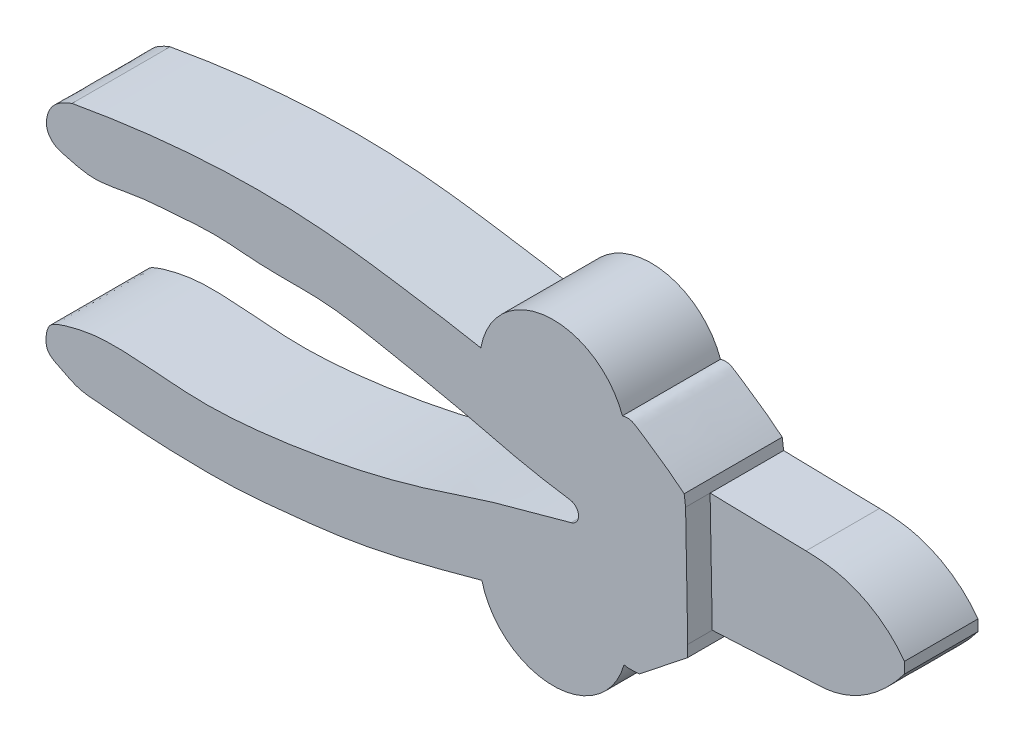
ISO-10303-21;
HEADER;
FILE_DESCRIPTION(('STEP AP214'),'2;1');
FILE_NAME('part.step','',(''),(''),'','','');
FILE_SCHEMA(('AUTOMOTIVE_DESIGN { 1 0 10303 214 1 1 1 1 }'));
ENDSEC;
DATA;
#1=APPLICATION_CONTEXT('core data for automotive mechanical design processes');
#2=APPLICATION_PROTOCOL_DEFINITION('international standard','automotive_design',2000,#1);
#3=PRODUCT_CONTEXT('',#1,'mechanical');
#4=PRODUCT('Part','Part','',(#3));
#5=PRODUCT_RELATED_PRODUCT_CATEGORY('part','',(#4));
#6=PRODUCT_DEFINITION_FORMATION('','',#4);
#7=PRODUCT_DEFINITION_CONTEXT('part definition',#1,'design');
#8=PRODUCT_DEFINITION('design','',#6,#7);
#9=PRODUCT_DEFINITION_SHAPE('','',#8);
#10=(LENGTH_UNIT() NAMED_UNIT(*) SI_UNIT(.MILLI.,.METRE.));
#11=(NAMED_UNIT(*) PLANE_ANGLE_UNIT() SI_UNIT($,.RADIAN.));
#12=(NAMED_UNIT(*) SI_UNIT($,.STERADIAN.) SOLID_ANGLE_UNIT());
#13=UNCERTAINTY_MEASURE_WITH_UNIT(LENGTH_MEASURE(1.E-05),#10,'distance_accuracy_value','');
#14=(GEOMETRIC_REPRESENTATION_CONTEXT(3) GLOBAL_UNCERTAINTY_ASSIGNED_CONTEXT((#13)) GLOBAL_UNIT_ASSIGNED_CONTEXT((#10,
#11,#12)) REPRESENTATION_CONTEXT('',''));
#15=CARTESIAN_POINT('',(0.,0.,0.));
#16=DIRECTION('',(0.,0.,1.));
#17=DIRECTION('',(1.,0.,0.));
#18=AXIS2_PLACEMENT_3D('',#15,#16,#17);
#19=CARTESIAN_POINT('',(130.670341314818,53.5969865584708,-10.));
#20=CARTESIAN_POINT('',(127.582049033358,56.174558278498,-10.));
#21=CARTESIAN_POINT('',(124.102974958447,58.4747826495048,-10.));
#22=CARTESIAN_POINT('',(119.574863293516,61.4612298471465,-10.));
#23=CARTESIAN_POINT('',(116.65580589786,60.786434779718,-10.));
#24=CARTESIAN_POINT('',(113.853404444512,58.2935868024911,-10.));
#25=CARTESIAN_POINT('',(110.012577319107,56.7935008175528,-10.));
#26=CARTESIAN_POINT('',(106.321528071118,56.0795872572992,-10.));
#27=CARTESIAN_POINT('',(101.15012316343,55.817356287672,-10.));
#28=CARTESIAN_POINT('',(90.8050801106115,58.5592760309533,-10.));
#29=CARTESIAN_POINT('',(75.7627766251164,60.9190498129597,-10.));
#30=CARTESIAN_POINT('',(56.2781941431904,63.8141121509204,-10.));
#31=CARTESIAN_POINT('',(33.0026154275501,64.0741475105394,-10.));
#32=CARTESIAN_POINT('',(15.6988326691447,61.9039957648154,-10.));
#33=CARTESIAN_POINT('',(5.81628602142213,60.1249827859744,-10.));
#34=B_SPLINE_CURVE_WITH_KNOTS('',3,(#19,#20,#21,#22,#23,#24,#25,#26,#27,#28,#29,#30,#31,#32,
#33),.UNSPECIFIED.,.F.,.F.,(4,1,1,1,1,1,1,1,1,1,1,1,4),(0.,0.0899269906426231,0.103200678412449,
0.121465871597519,0.153431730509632,0.190278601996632,0.215166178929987,0.240812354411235,
0.309768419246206,0.461106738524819,0.595674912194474,0.76668931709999,1.),.UNSPECIFIED.);
#35=DIRECTION('',(0.,0.,1.));
#36=VECTOR('',#35,1.);
#37=SURFACE_OF_LINEAR_EXTRUSION('',#34,#36);
#38=DIRECTION('',(0.,0.,1.));
#39=VECTOR('',#38,1.);
#40=CARTESIAN_POINT('',(118.079173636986,61.0581425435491,-10.));
#41=LINE('',#40,#39);
#42=CARTESIAN_POINT('',(118.079173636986,61.0581425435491,10.));
#43=VERTEX_POINT('',#42);
#44=CARTESIAN_POINT('',(118.079173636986,61.0581425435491,-10.));
#45=VERTEX_POINT('',#44);
#46=EDGE_CURVE('E65',#43,#45,#41,.F.);
#47=ORIENTED_EDGE('',*,*,#46,.F.);
#48=CARTESIAN_POINT('',(130.670341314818,53.5969865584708,10.));
#49=CARTESIAN_POINT('',(127.582049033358,56.174558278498,10.));
#50=CARTESIAN_POINT('',(124.102974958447,58.4747826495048,10.));
#51=CARTESIAN_POINT('',(119.574863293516,61.4612298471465,10.));
#52=CARTESIAN_POINT('',(116.65580589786,60.786434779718,10.));
#53=CARTESIAN_POINT('',(113.853404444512,58.2935868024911,10.));
#54=CARTESIAN_POINT('',(110.012577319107,56.7935008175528,10.));
#55=CARTESIAN_POINT('',(106.321528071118,56.0795872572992,10.));
#56=CARTESIAN_POINT('',(101.15012316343,55.817356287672,10.));
#57=CARTESIAN_POINT('',(90.8050801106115,58.5592760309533,10.));
#58=CARTESIAN_POINT('',(75.7627766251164,60.9190498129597,10.));
#59=CARTESIAN_POINT('',(56.2781941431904,63.8141121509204,10.));
#60=CARTESIAN_POINT('',(33.0026154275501,64.0741475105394,10.));
#61=CARTESIAN_POINT('',(15.6988326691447,61.9039957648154,10.));
#62=CARTESIAN_POINT('',(5.81628602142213,60.1249827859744,10.));
#63=B_SPLINE_CURVE_WITH_KNOTS('',3,(#48,#49,#50,#51,#52,#53,#54,#55,#56,#57,#58,#59,#60,#61,
#62),.UNSPECIFIED.,.F.,.F.,(4,1,1,1,1,1,1,1,1,1,1,1,4),(0.,0.0899269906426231,0.103200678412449,
0.121465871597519,0.153431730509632,0.190278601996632,0.215166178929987,0.240812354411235,
0.309768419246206,0.461106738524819,0.595674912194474,0.76668931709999,1.),.UNSPECIFIED.);
#64=CARTESIAN_POINT('',(130.670341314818,53.5969865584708,10.));
#65=VERTEX_POINT('',#64);
#66=EDGE_CURVE('E282',#65,#43,#63,.T.);
#67=ORIENTED_EDGE('',*,*,#66,.F.);
#68=DIRECTION('',(0.,0.,1.));
#69=VECTOR('',#68,1.);
#70=CARTESIAN_POINT('',(130.670341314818,53.5969865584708,-10.));
#71=LINE('',#70,#69);
#72=CARTESIAN_POINT('',(130.670341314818,53.5969865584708,-10.));
#73=VERTEX_POINT('',#72);
#74=EDGE_CURVE('E50',#73,#65,#71,.T.);
#75=ORIENTED_EDGE('',*,*,#74,.F.);
#76=EDGE_CURVE('E173',#73,#45,#34,.T.);
#77=ORIENTED_EDGE('',*,*,#76,.T.);
#78=EDGE_LOOP('',(#47,#67,#75,#77));
#79=FACE_BOUND('',#78,.T.);
#80=ADVANCED_FACE('F39',(#79),#37,.T.);
#81=CARTESIAN_POINT('',(107.631043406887,36.9688561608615,-10.));
#82=CARTESIAN_POINT('',(105.514246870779,36.4166758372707,-10.));
#83=CARTESIAN_POINT('',(99.904669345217,34.8028938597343,-10.));
#84=CARTESIAN_POINT('',(91.0526788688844,32.5466295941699,-10.));
#85=CARTESIAN_POINT('',(79.4929765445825,28.5194008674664,-10.));
#86=CARTESIAN_POINT('',(64.9854108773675,24.466117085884,-10.));
#87=CARTESIAN_POINT('',(47.9400830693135,21.5186797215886,-10.));
#88=CARTESIAN_POINT('',(30.3219440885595,19.9971671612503,-10.));
#89=CARTESIAN_POINT('',(16.3278229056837,22.0922666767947,-10.));
#90=CARTESIAN_POINT('',(8.12908770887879,21.207067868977,-10.));
#91=CARTESIAN_POINT('',(2.50448996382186,19.6545138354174,-10.));
#92=CARTESIAN_POINT('',(0.667360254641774,18.3873921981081,-10.));
#93=CARTESIAN_POINT('',(0.2327487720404,13.5843300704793,-10.));
#94=CARTESIAN_POINT('',(3.59907317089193,12.2198313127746,-10.));
#95=CARTESIAN_POINT('',(7.07276903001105,10.0752299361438,-10.));
#96=CARTESIAN_POINT('',(13.1445993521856,9.88992390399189,-10.));
#97=CARTESIAN_POINT('',(20.4888145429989,9.04797817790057,-10.));
#98=CARTESIAN_POINT('',(28.7595567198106,8.79637655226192,-10.));
#99=CARTESIAN_POINT('',(38.9055645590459,8.63995948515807,-10.));
#100=CARTESIAN_POINT('',(50.154878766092,9.69908961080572,-10.));
#101=CARTESIAN_POINT('',(64.170489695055,11.2948240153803,-10.));
#102=CARTESIAN_POINT('',(78.5802508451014,14.6633979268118,-10.));
#103=CARTESIAN_POINT('',(91.5208540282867,18.2751411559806,-10.));
#104=CARTESIAN_POINT('',(100.457654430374,20.6147764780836,-10.));
#105=CARTESIAN_POINT('',(106.045114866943,21.8088804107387,-10.));
#106=CARTESIAN_POINT('',(109.85366118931,20.5152705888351,-10.));
#107=CARTESIAN_POINT('',(113.649038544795,20.0647823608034,-10.));
#108=CARTESIAN_POINT('',(116.229044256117,18.2449560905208,-10.));
#109=CARTESIAN_POINT('',(118.917311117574,16.8999095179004,-10.));
#110=CARTESIAN_POINT('',(120.576107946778,17.1537176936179,-10.));
#111=CARTESIAN_POINT('',(121.535114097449,17.1822051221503,-10.));
#112=B_SPLINE_CURVE_WITH_KNOTS('',3,(#81,#82,#83,#84,#85,#86,#87,#88,#89,#90,#91,#92,#93,#94,
#95,#96,#97,#98,#99,#100,#101,#102,#103,#104,#105,#106,#107,#108,#109,#110,#111),.UNSPECIFIED.,
.F.,.F.,(4,1,1,1,1,1,1,1,1,1,1,1,1,1,1,1,1,1,1,1,1,1,1,1,1,1,1,1,4),(0.0810280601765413,
0.106672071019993,0.14946604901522,0.188046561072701,0.250096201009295,0.325958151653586,
0.38991182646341,0.459083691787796,0.482403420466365,0.497912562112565,0.508619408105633,
0.515569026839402,0.527235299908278,0.541796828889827,0.566367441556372,0.594733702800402,
0.629745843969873,0.662872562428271,0.713748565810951,0.76199078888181,0.828130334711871,
0.887058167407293,0.918984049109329,0.937487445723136,0.952094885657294,0.965348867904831,
0.981602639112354,0.988450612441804,1.),.UNSPECIFIED.);
#113=DIRECTION('',(0.,0.,1.));
#114=VECTOR('',#113,1.);
#115=SURFACE_OF_LINEAR_EXTRUSION('',#112,#114);
#116=DIRECTION('',(0.,0.,1.));
#117=VECTOR('',#116,1.);
#118=CARTESIAN_POINT('',(89.4061417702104,17.6689053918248,-10.));
#119=LINE('',#118,#117);
#120=CARTESIAN_POINT('',(89.4061417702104,17.6689053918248,10.));
#121=VERTEX_POINT('',#120);
#122=CARTESIAN_POINT('',(89.4061417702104,17.6689053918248,-10.));
#123=VERTEX_POINT('',#122);
#124=EDGE_CURVE('E204',#121,#123,#119,.F.);
#125=ORIENTED_EDGE('',*,*,#124,.F.);
#126=CARTESIAN_POINT('',(107.631043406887,36.9688561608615,10.));
#127=CARTESIAN_POINT('',(105.514246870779,36.4166758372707,10.));
#128=CARTESIAN_POINT('',(99.904669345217,34.8028938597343,10.));
#129=CARTESIAN_POINT('',(91.0526788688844,32.5466295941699,10.));
#130=CARTESIAN_POINT('',(79.4929765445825,28.5194008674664,10.));
#131=CARTESIAN_POINT('',(64.9854108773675,24.466117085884,10.));
#132=CARTESIAN_POINT('',(47.9400830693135,21.5186797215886,10.));
#133=CARTESIAN_POINT('',(30.3219440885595,19.9971671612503,10.));
#134=CARTESIAN_POINT('',(16.3278229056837,22.0922666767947,10.));
#135=CARTESIAN_POINT('',(8.12908770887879,21.207067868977,10.));
#136=CARTESIAN_POINT('',(2.50448996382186,19.6545138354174,10.));
#137=CARTESIAN_POINT('',(0.667360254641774,18.3873921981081,10.));
#138=CARTESIAN_POINT('',(0.2327487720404,13.5843300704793,10.));
#139=CARTESIAN_POINT('',(3.59907317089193,12.2198313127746,10.));
#140=CARTESIAN_POINT('',(7.07276903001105,10.0752299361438,10.));
#141=CARTESIAN_POINT('',(13.1445993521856,9.88992390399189,10.));
#142=CARTESIAN_POINT('',(20.4888145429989,9.04797817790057,10.));
#143=CARTESIAN_POINT('',(28.7595567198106,8.79637655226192,10.));
#144=CARTESIAN_POINT('',(38.9055645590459,8.63995948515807,10.));
#145=CARTESIAN_POINT('',(50.154878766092,9.69908961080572,10.));
#146=CARTESIAN_POINT('',(64.170489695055,11.2948240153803,10.));
#147=CARTESIAN_POINT('',(78.5802508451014,14.6633979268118,10.));
#148=CARTESIAN_POINT('',(91.5208540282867,18.2751411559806,10.));
#149=CARTESIAN_POINT('',(100.457654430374,20.6147764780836,10.));
#150=CARTESIAN_POINT('',(106.045114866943,21.8088804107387,10.));
#151=CARTESIAN_POINT('',(109.85366118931,20.5152705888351,10.));
#152=CARTESIAN_POINT('',(113.649038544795,20.0647823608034,10.));
#153=CARTESIAN_POINT('',(116.229044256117,18.2449560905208,10.));
#154=CARTESIAN_POINT('',(118.917311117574,16.8999095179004,10.));
#155=CARTESIAN_POINT('',(120.576107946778,17.1537176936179,10.));
#156=CARTESIAN_POINT('',(121.535114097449,17.1822051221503,10.));
#157=B_SPLINE_CURVE_WITH_KNOTS('',3,(#126,#127,#128,#129,#130,#131,#132,#133,#134,#135,#136,
#137,#138,#139,#140,#141,#142,#143,#144,#145,#146,#147,#148,#149,#150,#151,#152,#153,#154,#155,
#156),.UNSPECIFIED.,.F.,.F.,(4,1,1,1,1,1,1,1,1,1,1,1,1,1,1,1,1,1,1,1,1,1,1,1,1,1,1,1,4),
(0.0810280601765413,0.106672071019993,0.14946604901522,0.188046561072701,0.250096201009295,
0.325958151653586,0.38991182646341,0.459083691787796,0.482403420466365,0.497912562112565,
0.508619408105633,0.515569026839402,0.527235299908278,0.541796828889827,0.566367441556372,
0.594733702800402,0.629745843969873,0.662872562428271,0.713748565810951,0.76199078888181,
0.828130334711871,0.887058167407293,0.918984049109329,0.937487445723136,0.952094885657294,
0.965348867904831,0.981602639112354,0.988450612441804,1.),.UNSPECIFIED.);
#158=CARTESIAN_POINT('',(107.631043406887,36.9688561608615,10.));
#159=VERTEX_POINT('',#158);
#160=EDGE_CURVE('E262',#159,#121,#157,.T.);
#161=ORIENTED_EDGE('',*,*,#160,.F.);
#162=DIRECTION('',(0.,0.,1.));
#163=VECTOR('',#162,1.);
#164=CARTESIAN_POINT('',(107.631043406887,36.9688561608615,-10.));
#165=LINE('',#164,#163);
#166=CARTESIAN_POINT('',(107.631043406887,36.9688561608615,-10.));
#167=VERTEX_POINT('',#166);
#168=EDGE_CURVE('E354',#167,#159,#165,.T.);
#169=ORIENTED_EDGE('',*,*,#168,.F.);
#170=EDGE_CURVE('E302',#167,#123,#112,.T.);
#171=ORIENTED_EDGE('',*,*,#170,.T.);
#172=EDGE_LOOP('',(#125,#161,#169,#171));
#173=FACE_BOUND('',#172,.T.);
#174=ADVANCED_FACE('F320',(#173),#115,.T.);
#175=CARTESIAN_POINT('',(49.0682125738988,50.8274607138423,10.));
#176=DIRECTION('',(0.,0.,-1.));
#177=DIRECTION('',(-1.,0.,0.));
#178=AXIS2_PLACEMENT_3D('',#175,#176,#177);
#179=PLANE('',#178);
#180=CARTESIAN_POINT('',(103.959159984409,55.9960071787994,10.));
#181=DIRECTION('',(0.,0.,-1.));
#182=DIRECTION('',(-1.,0.,0.));
#183=AXIS2_PLACEMENT_3D('',#180,#181,#182);
#184=CIRCLE('',#183,15.);
#185=CARTESIAN_POINT('',(89.1911299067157,58.6237985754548,10.));
#186=VERTEX_POINT('',#185);
#187=EDGE_CURVE('E182',#186,#43,#184,.T.);
#188=ORIENTED_EDGE('',*,*,#187,.F.);
#189=CARTESIAN_POINT('',(5.81628602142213,60.1249827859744,10.));
#190=VERTEX_POINT('',#189);
#191=EDGE_CURVE('E57',#186,#190,#63,.T.);
#192=ORIENTED_EDGE('',*,*,#191,.T.);
#193=CARTESIAN_POINT('',(5.81628602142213,60.1249827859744,10.));
#194=CARTESIAN_POINT('',(4.3538864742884,59.5831206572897,10.));
#195=CARTESIAN_POINT('',(1.87170258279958,58.3787619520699,10.));
#196=CARTESIAN_POINT('',(0.65588897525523,55.4852063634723,10.));
#197=CARTESIAN_POINT('',(0.460769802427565,53.1953633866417,10.));
#198=CARTESIAN_POINT('',(1.78766606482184,50.8322783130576,10.));
#199=CARTESIAN_POINT('',(5.40347109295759,49.9342499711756,10.));
#200=CARTESIAN_POINT('',(9.05328386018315,48.9523707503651,10.));
#201=CARTESIAN_POINT('',(13.9026027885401,49.3507800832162,10.));
#202=CARTESIAN_POINT('',(19.4903782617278,50.5632919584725,10.));
#203=CARTESIAN_POINT('',(27.1307043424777,51.0527895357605,10.));
#204=CARTESIAN_POINT('',(35.4891630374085,51.7621411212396,10.));
#205=CARTESIAN_POINT('',(45.6613471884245,50.5457386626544,10.));
#206=CARTESIAN_POINT('',(57.8234122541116,51.2509936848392,10.));
#207=CARTESIAN_POINT('',(70.8200134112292,48.5009042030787,10.));
#208=CARTESIAN_POINT('',(83.6803631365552,46.0658014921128,10.));
#209=CARTESIAN_POINT('',(95.4013637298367,42.9468980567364,10.));
#210=CARTESIAN_POINT('',(103.513106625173,41.4420135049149,10.));
#211=CARTESIAN_POINT('',(107.409788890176,40.8838923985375,10.));
#212=B_SPLINE_CURVE_WITH_KNOTS('',3,(#193,#194,#195,#196,#197,#198,#199,#200,#201,#202,#203,
#204,#205,#206,#207,#208,#209,#210,#211),.UNSPECIFIED.,.F.,.F.,(4,1,1,1,1,1,1,1,1,1,1,1,1,1,1,1,
4),(0.,0.0345604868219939,0.0540576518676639,0.0644683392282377,0.0833328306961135,
0.105795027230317,0.140989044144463,0.164717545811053,0.208938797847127,0.263787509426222,
0.328630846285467,0.388382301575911,0.482797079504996,0.588359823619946,0.671565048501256,
0.763907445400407,0.84833473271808),.UNSPECIFIED.);
#213=CARTESIAN_POINT('',(107.409788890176,40.8838923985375,10.));
#214=VERTEX_POINT('',#213);
#215=EDGE_CURVE('E245',#190,#214,#212,.T.);
#216=ORIENTED_EDGE('',*,*,#215,.T.);
#217=CARTESIAN_POINT('',(107.126223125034,38.904096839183,10.));
#218=DIRECTION('',(0.,0.,-1.));
#219=DIRECTION('',(1.,0.,0.));
#220=AXIS2_PLACEMENT_3D('',#217,#218,#219);
#221=CIRCLE('',#220,2.00000000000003);
#222=EDGE_CURVE('E254',#214,#159,#221,.T.);
#223=ORIENTED_EDGE('',*,*,#222,.T.);
#224=ORIENTED_EDGE('',*,*,#160,.T.);
#225=CARTESIAN_POINT('',(103.959159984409,21.303415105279,10.));
#226=DIRECTION('',(0.,0.,-1.));
#227=DIRECTION('',(-1.,0.,0.));
#228=AXIS2_PLACEMENT_3D('',#225,#226,#227);
#229=CIRCLE('',#228,15.);
#230=CARTESIAN_POINT('',(118.404827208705,17.2632791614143,10.));
#231=VERTEX_POINT('',#230);
#232=EDGE_CURVE('E193',#231,#121,#229,.T.);
#233=ORIENTED_EDGE('',*,*,#232,.F.);
#234=CARTESIAN_POINT('',(121.535114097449,17.1822051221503,10.));
#235=VERTEX_POINT('',#234);
#236=EDGE_CURVE('E261',#231,#235,#157,.T.);
#237=ORIENTED_EDGE('',*,*,#236,.T.);
#238=DIRECTION('',(0.783057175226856,0.621949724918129,0.));
#239=VECTOR('',#238,1.);
#240=CARTESIAN_POINT('',(131.399218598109,25.0168528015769,10.));
#241=LINE('',#240,#239);
#242=CARTESIAN_POINT('',(131.399218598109,25.0168528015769,10.));
#243=VERTEX_POINT('',#242);
#244=EDGE_CURVE('E268',#235,#243,#241,.T.);
#245=ORIENTED_EDGE('',*,*,#244,.T.);
#246=DIRECTION('',(0.,1.,0.));
#247=VECTOR('',#246,1.);
#248=CARTESIAN_POINT('',(131.399218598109,27.3549585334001,10.));
#249=LINE('',#248,#247);
#250=CARTESIAN_POINT('',(131.399218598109,27.3549585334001,10.));
#251=VERTEX_POINT('',#250);
#252=EDGE_CURVE('E275',#243,#251,#249,.T.);
#253=ORIENTED_EDGE('',*,*,#252,.T.);
#254=DIRECTION('',(-0.0183211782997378,0.999832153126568,0.));
#255=VECTOR('',#254,1.);
#256=CARTESIAN_POINT('',(130.959159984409,51.3700488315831,10.));
#257=LINE('',#256,#255);
#258=CARTESIAN_POINT('',(130.959159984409,51.3700488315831,10.));
#259=VERTEX_POINT('',#258);
#260=EDGE_CURVE('E225',#251,#259,#257,.T.);
#261=ORIENTED_EDGE('',*,*,#260,.T.);
#262=DIRECTION('',(-0.128616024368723,0.991694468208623,0.));
#263=VECTOR('',#262,1.);
#264=CARTESIAN_POINT('',(130.670341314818,53.5969865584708,10.));
#265=LINE('',#264,#263);
#266=EDGE_CURVE('E278',#259,#65,#265,.T.);
#267=ORIENTED_EDGE('',*,*,#266,.T.);
#268=ORIENTED_EDGE('',*,*,#66,.T.);
#269=EDGE_LOOP('',(#188,#192,#216,#223,#224,#233,#237,#245,#253,#261,#267,#268));
#270=FACE_BOUND('',#269,.T.);
#271=ADVANCED_FACE('F334',(#270),#179,.F.);
#272=CARTESIAN_POINT('',(5.81628602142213,60.1249827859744,-10.));
#273=CARTESIAN_POINT('',(4.3538864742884,59.5831206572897,-10.));
#274=CARTESIAN_POINT('',(1.87170258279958,58.3787619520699,-10.));
#275=CARTESIAN_POINT('',(0.65588897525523,55.4852063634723,-10.));
#276=CARTESIAN_POINT('',(0.460769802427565,53.1953633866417,-10.));
#277=CARTESIAN_POINT('',(1.78766606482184,50.8322783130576,-10.));
#278=CARTESIAN_POINT('',(5.40347109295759,49.9342499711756,-10.));
#279=CARTESIAN_POINT('',(9.05328386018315,48.9523707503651,-10.));
#280=CARTESIAN_POINT('',(13.9026027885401,49.3507800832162,-10.));
#281=CARTESIAN_POINT('',(19.4903782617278,50.5632919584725,-10.));
#282=CARTESIAN_POINT('',(27.1307043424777,51.0527895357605,-10.));
#283=CARTESIAN_POINT('',(35.4891630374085,51.7621411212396,-10.));
#284=CARTESIAN_POINT('',(45.6613471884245,50.5457386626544,-10.));
#285=CARTESIAN_POINT('',(57.8234122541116,51.2509936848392,-10.));
#286=CARTESIAN_POINT('',(70.8200134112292,48.5009042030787,-10.));
#287=CARTESIAN_POINT('',(83.6803631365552,46.0658014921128,-10.));
#288=CARTESIAN_POINT('',(95.4013637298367,42.9468980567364,-10.));
#289=CARTESIAN_POINT('',(103.513106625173,41.4420135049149,-10.));
#290=CARTESIAN_POINT('',(107.409788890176,40.8838923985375,-10.));
#291=B_SPLINE_CURVE_WITH_KNOTS('',3,(#272,#273,#274,#275,#276,#277,#278,#279,#280,#281,#282,
#283,#284,#285,#286,#287,#288,#289,#290),.UNSPECIFIED.,.F.,.F.,(4,1,1,1,1,1,1,1,1,1,1,1,1,1,1,1,
4),(0.,0.0345604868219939,0.0540576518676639,0.0644683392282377,0.0833328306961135,
0.105795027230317,0.140989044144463,0.164717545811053,0.208938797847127,0.263787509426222,
0.328630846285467,0.388382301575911,0.482797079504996,0.588359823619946,0.671565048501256,
0.763907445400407,0.84833473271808),.UNSPECIFIED.);
#292=DIRECTION('',(0.,0.,1.));
#293=VECTOR('',#292,1.);
#294=SURFACE_OF_LINEAR_EXTRUSION('',#291,#293);
#295=DIRECTION('',(0.,0.,1.));
#296=VECTOR('',#295,1.);
#297=CARTESIAN_POINT('',(107.409788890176,40.8838923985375,-10.));
#298=LINE('',#297,#296);
#299=CARTESIAN_POINT('',(107.409788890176,40.8838923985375,-10.));
#300=VERTEX_POINT('',#299);
#301=EDGE_CURVE('E44',#300,#214,#298,.T.);
#302=ORIENTED_EDGE('',*,*,#301,.T.);
#303=ORIENTED_EDGE('',*,*,#215,.F.);
#304=DIRECTION('',(0.,0.,1.));
#305=VECTOR('',#304,1.);
#306=CARTESIAN_POINT('',(5.81628602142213,60.1249827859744,-10.));
#307=LINE('',#306,#305);
#308=CARTESIAN_POINT('',(5.81628602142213,60.1249827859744,-10.));
#309=VERTEX_POINT('',#308);
#310=EDGE_CURVE('E11',#309,#190,#307,.T.);
#311=ORIENTED_EDGE('',*,*,#310,.F.);
#312=EDGE_CURVE('E170',#309,#300,#291,.T.);
#313=ORIENTED_EDGE('',*,*,#312,.T.);
#314=EDGE_LOOP('',(#302,#303,#311,#313));
#315=FACE_BOUND('',#314,.T.);
#316=ADVANCED_FACE('F41',(#315),#294,.T.);
#317=DIRECTION('',(0.,0.,1.));
#318=VECTOR('',#317,1.);
#319=CARTESIAN_POINT('',(89.1911299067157,58.6237985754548,-10.));
#320=LINE('',#319,#318);
#321=CARTESIAN_POINT('',(89.1911299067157,58.6237985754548,-10.));
#322=VERTEX_POINT('',#321);
#323=EDGE_CURVE('E176',#322,#186,#320,.T.);
#324=ORIENTED_EDGE('',*,*,#323,.F.);
#325=EDGE_CURVE('E163',#322,#309,#34,.T.);
#326=ORIENTED_EDGE('',*,*,#325,.T.);
#327=ORIENTED_EDGE('',*,*,#310,.T.);
#328=ORIENTED_EDGE('',*,*,#191,.F.);
#329=EDGE_LOOP('',(#324,#326,#327,#328));
#330=FACE_BOUND('',#329,.T.);
#331=ADVANCED_FACE('F177',(#330),#37,.T.);
#332=CARTESIAN_POINT('',(130.670341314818,53.5969865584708,-10.));
#333=DIRECTION('',(0.991694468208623,0.128616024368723,0.));
#334=DIRECTION('',(-0.128616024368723,0.991694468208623,0.));
#335=AXIS2_PLACEMENT_3D('',#332,#333,#334);
#336=PLANE('',#335);
#337=ORIENTED_EDGE('',*,*,#74,.T.);
#338=ORIENTED_EDGE('',*,*,#266,.F.);
#339=DIRECTION('',(0.,0.,-1.));
#340=VECTOR('',#339,1.);
#341=CARTESIAN_POINT('',(130.959159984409,51.3700488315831,235.344985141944));
#342=LINE('',#341,#340);
#343=CARTESIAN_POINT('',(130.959159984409,51.3700488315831,5.));
#344=VERTEX_POINT('',#343);
#345=EDGE_CURVE('E214',#259,#344,#342,.T.);
#346=ORIENTED_EDGE('',*,*,#345,.T.);
#347=DIRECTION('',(0.,0.,1.));
#348=VECTOR('',#347,1.);
#349=CARTESIAN_POINT('',(130.959159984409,51.3700488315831,-10.));
#350=LINE('',#349,#348);
#351=CARTESIAN_POINT('',(130.959159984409,51.3700488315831,-10.));
#352=VERTEX_POINT('',#351);
#353=EDGE_CURVE('E449',#352,#344,#350,.T.);
#354=ORIENTED_EDGE('',*,*,#353,.F.);
#355=DIRECTION('',(-0.128616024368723,0.991694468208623,0.));
#356=VECTOR('',#355,1.);
#357=CARTESIAN_POINT('',(130.670341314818,53.5969865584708,-10.));
#358=LINE('',#357,#356);
#359=EDGE_CURVE('E174',#352,#73,#358,.T.);
#360=ORIENTED_EDGE('',*,*,#359,.T.);
#361=EDGE_LOOP('',(#337,#338,#346,#354,#360));
#362=FACE_BOUND('',#361,.T.);
#363=ADVANCED_FACE('F338',(#362),#336,.T.);
#364=CARTESIAN_POINT('',(130.959159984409,51.3700488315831,-10.));
#365=DIRECTION('',(0.0225035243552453,0.999746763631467,0.));
#366=DIRECTION('',(-0.999746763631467,0.0225035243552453,0.));
#367=AXIS2_PLACEMENT_3D('',#364,#365,#366);
#368=PLANE('',#367);
#369=DIRECTION('',(0.999746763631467,-0.0225035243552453,0.));
#370=VECTOR('',#369,1.);
#371=CARTESIAN_POINT('',(150.519113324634,50.9297694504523,5.));
#372=LINE('',#371,#370);
#373=CARTESIAN_POINT('',(150.519113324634,50.9297694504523,5.));
#374=VERTEX_POINT('',#373);
#375=EDGE_CURVE('E224',#344,#374,#372,.T.);
#376=ORIENTED_EDGE('',*,*,#375,.T.);
#377=DIRECTION('',(0.,0.,1.));
#378=VECTOR('',#377,1.);
#379=CARTESIAN_POINT('',(150.519113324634,50.9297694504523,-10.));
#380=LINE('',#379,#378);
#381=CARTESIAN_POINT('',(150.519113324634,50.9297694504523,-10.));
#382=VERTEX_POINT('',#381);
#383=EDGE_CURVE('E452',#382,#374,#380,.T.);
#384=ORIENTED_EDGE('',*,*,#383,.F.);
#385=DIRECTION('',(-0.999746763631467,0.0225035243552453,0.));
#386=VECTOR('',#385,1.);
#387=CARTESIAN_POINT('',(130.959159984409,51.3700488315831,-10.));
#388=LINE('',#387,#386);
#389=EDGE_CURVE('E387',#382,#352,#388,.T.);
#390=ORIENTED_EDGE('',*,*,#389,.T.);
#391=ORIENTED_EDGE('',*,*,#353,.T.);
#392=EDGE_LOOP('',(#376,#384,#390,#391));
#393=FACE_BOUND('',#392,.T.);
#394=ADVANCED_FACE('F343',(#393),#368,.T.);
#395=CARTESIAN_POINT('',(170.604350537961,41.4560387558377,-10.));
#396=CARTESIAN_POINT('',(167.554511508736,45.6901682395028,-10.));
#397=CARTESIAN_POINT('',(160.682355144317,50.2529500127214,-10.));
#398=CARTESIAN_POINT('',(152.944425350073,50.8751775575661,-10.));
#399=CARTESIAN_POINT('',(150.519113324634,50.9297694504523,-10.));
#400=B_SPLINE_CURVE_WITH_KNOTS('',3,(#395,#396,#397,#398,#399),.UNSPECIFIED.,.F.,.F.,(4,1,4),
(0.,0.68195547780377,1.),.UNSPECIFIED.);
#401=DIRECTION('',(0.,0.,1.));
#402=VECTOR('',#401,1.);
#403=SURFACE_OF_LINEAR_EXTRUSION('',#400,#402);
#404=CARTESIAN_POINT('',(170.604350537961,41.4560387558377,5.00000000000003));
#405=CARTESIAN_POINT('',(167.554511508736,45.6901682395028,5.00000000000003));
#406=CARTESIAN_POINT('',(160.682355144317,50.2529500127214,5.00000000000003));
#407=CARTESIAN_POINT('',(152.944425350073,50.8751775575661,5.00000000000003));
#408=CARTESIAN_POINT('',(150.519113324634,50.9297694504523,5.00000000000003));
#409=B_SPLINE_CURVE_WITH_KNOTS('',3,(#404,#405,#406,#407,#408),.UNSPECIFIED.,.F.,.F.,(4,1,4),
(0.,0.68195547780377,1.),.UNSPECIFIED.);
#410=CARTESIAN_POINT('',(170.604350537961,41.4560387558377,5.));
#411=VERTEX_POINT('',#410);
#412=EDGE_CURVE('E216',#374,#411,#409,.F.);
#413=ORIENTED_EDGE('',*,*,#412,.T.);
#414=DIRECTION('',(0.,0.,1.));
#415=VECTOR('',#414,1.);
#416=CARTESIAN_POINT('',(170.604350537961,41.4560387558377,-10.));
#417=LINE('',#416,#415);
#418=CARTESIAN_POINT('',(170.604350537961,41.4560387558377,-10.));
#419=VERTEX_POINT('',#418);
#420=EDGE_CURVE('E458',#419,#411,#417,.T.);
#421=ORIENTED_EDGE('',*,*,#420,.F.);
#422=EDGE_CURVE('E391',#419,#382,#400,.T.);
#423=ORIENTED_EDGE('',*,*,#422,.T.);
#424=ORIENTED_EDGE('',*,*,#383,.T.);
#425=EDGE_LOOP('',(#413,#421,#423,#424));
#426=FACE_BOUND('',#425,.T.);
#427=ADVANCED_FACE('F473',(#426),#403,.T.);
#428=CARTESIAN_POINT('',(170.604350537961,41.4560387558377,-10.));
#429=DIRECTION('',(1.,0.,0.));
#430=DIRECTION('',(0.,0.,-1.));
#431=AXIS2_PLACEMENT_3D('',#428,#429,#430);
#432=PLANE('',#431);
#433=DIRECTION('',(0.,1.,0.));
#434=VECTOR('',#433,1.);
#435=CARTESIAN_POINT('',(170.604350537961,41.4560387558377,5.));
#436=LINE('',#435,#434);
#437=CARTESIAN_POINT('',(170.604350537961,39.2076913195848,5.));
#438=VERTEX_POINT('',#437);
#439=EDGE_CURVE('E208',#438,#411,#436,.T.);
#440=ORIENTED_EDGE('',*,*,#439,.F.);
#441=DIRECTION('',(0.,0.,1.));
#442=VECTOR('',#441,1.);
#443=CARTESIAN_POINT('',(170.604350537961,39.2076913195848,-10.));
#444=LINE('',#443,#442);
#445=CARTESIAN_POINT('',(170.604350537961,39.2076913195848,-10.));
#446=VERTEX_POINT('',#445);
#447=EDGE_CURVE('E462',#446,#438,#444,.T.);
#448=ORIENTED_EDGE('',*,*,#447,.F.);
#449=DIRECTION('',(0.,1.,0.));
#450=VECTOR('',#449,1.);
#451=CARTESIAN_POINT('',(170.604350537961,41.4560387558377,-10.));
#452=LINE('',#451,#450);
#453=EDGE_CURVE('E395',#446,#419,#452,.T.);
#454=ORIENTED_EDGE('',*,*,#453,.T.);
#455=ORIENTED_EDGE('',*,*,#420,.T.);
#456=EDGE_LOOP('',(#440,#448,#454,#455));
#457=FACE_BOUND('',#456,.T.);
#458=ADVANCED_FACE('F423',(#457),#432,.T.);
#459=CARTESIAN_POINT('',(154.319460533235,28.5285853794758,-10.));
#460=CARTESIAN_POINT('',(161.049603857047,29.1962304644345,-10.));
#461=CARTESIAN_POINT('',(166.705993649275,34.0114210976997,-10.));
#462=CARTESIAN_POINT('',(170.604350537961,39.2076913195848,-10.));
#463=B_SPLINE_CURVE_WITH_KNOTS('',3,(#459,#460,#461,#462),.UNSPECIFIED.,.F.,.F.,(4,4),(0.,1.),.UNSPECIFIED.);
#464=DIRECTION('',(0.,0.,1.));
#465=VECTOR('',#464,1.);
#466=SURFACE_OF_LINEAR_EXTRUSION('',#463,#465);
#467=CARTESIAN_POINT('',(154.319460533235,28.5285853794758,5.));
#468=CARTESIAN_POINT('',(161.049603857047,29.1962304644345,5.));
#469=CARTESIAN_POINT('',(166.705993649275,34.0114210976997,5.));
#470=CARTESIAN_POINT('',(170.604350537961,39.2076913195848,5.));
#471=B_SPLINE_CURVE_WITH_KNOTS('',3,(#467,#468,#469,#470),.UNSPECIFIED.,.F.,.F.,(4,4),(0.,1.),.UNSPECIFIED.);
#472=CARTESIAN_POINT('',(154.319460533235,28.5285853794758,5.));
#473=VERTEX_POINT('',#472);
#474=EDGE_CURVE('E209',#438,#473,#471,.F.);
#475=ORIENTED_EDGE('',*,*,#474,.T.);
#476=DIRECTION('',(0.,0.,1.));
#477=VECTOR('',#476,1.);
#478=CARTESIAN_POINT('',(154.319460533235,28.5285853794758,-10.));
#479=LINE('',#478,#477);
#480=CARTESIAN_POINT('',(154.319460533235,28.5285853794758,-10.));
#481=VERTEX_POINT('',#480);
#482=EDGE_CURVE('E379',#481,#473,#479,.T.);
#483=ORIENTED_EDGE('',*,*,#482,.F.);
#484=EDGE_CURVE('E399',#481,#446,#463,.T.);
#485=ORIENTED_EDGE('',*,*,#484,.T.);
#486=ORIENTED_EDGE('',*,*,#447,.T.);
#487=EDGE_LOOP('',(#475,#483,#485,#486));
#488=FACE_BOUND('',#487,.T.);
#489=ADVANCED_FACE('F418',(#488),#466,.T.);
#490=CARTESIAN_POINT('',(131.399218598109,27.3549585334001,-10.));
#491=DIRECTION('',(0.0511378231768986,-0.998691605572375,0.));
#492=DIRECTION('',(0.998691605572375,0.0511378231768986,0.));
#493=AXIS2_PLACEMENT_3D('',#490,#491,#492);
#494=PLANE('',#493);
#495=DIRECTION('',(-0.998691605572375,-0.0511378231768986,0.));
#496=VECTOR('',#495,1.);
#497=CARTESIAN_POINT('',(131.399218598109,27.3549585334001,5.));
#498=LINE('',#497,#496);
#499=CARTESIAN_POINT('',(131.399218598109,27.3549585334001,5.));
#500=VERTEX_POINT('',#499);
#501=EDGE_CURVE('E215',#473,#500,#498,.T.);
#502=ORIENTED_EDGE('',*,*,#501,.T.);
#503=DIRECTION('',(0.,0.,1.));
#504=VECTOR('',#503,1.);
#505=CARTESIAN_POINT('',(131.399218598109,27.3549585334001,-10.));
#506=LINE('',#505,#504);
#507=CARTESIAN_POINT('',(131.399218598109,27.3549585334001,-10.));
#508=VERTEX_POINT('',#507);
#509=EDGE_CURVE('E375',#508,#500,#506,.T.);
#510=ORIENTED_EDGE('',*,*,#509,.F.);
#511=DIRECTION('',(0.998691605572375,0.0511378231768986,0.));
#512=VECTOR('',#511,1.);
#513=CARTESIAN_POINT('',(131.399218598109,27.3549585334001,-10.));
#514=LINE('',#513,#512);
#515=EDGE_CURVE('E403',#508,#481,#514,.T.);
#516=ORIENTED_EDGE('',*,*,#515,.T.);
#517=ORIENTED_EDGE('',*,*,#482,.T.);
#518=EDGE_LOOP('',(#502,#510,#516,#517));
#519=FACE_BOUND('',#518,.T.);
#520=ADVANCED_FACE('F422',(#519),#494,.T.);
#521=CARTESIAN_POINT('',(131.399218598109,27.3549585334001,-10.));
#522=DIRECTION('',(1.,0.,0.));
#523=DIRECTION('',(0.,0.,-1.));
#524=AXIS2_PLACEMENT_3D('',#521,#522,#523);
#525=PLANE('',#524);
#526=ORIENTED_EDGE('',*,*,#509,.T.);
#527=DIRECTION('',(0.,0.,-1.));
#528=VECTOR('',#527,1.);
#529=CARTESIAN_POINT('',(131.399218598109,27.3549585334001,235.344985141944));
#530=LINE('',#529,#528);
#531=EDGE_CURVE('E241',#251,#500,#530,.T.);
#532=ORIENTED_EDGE('',*,*,#531,.F.);
#533=ORIENTED_EDGE('',*,*,#252,.F.);
#534=DIRECTION('',(0.,0.,1.));
#535=VECTOR('',#534,1.);
#536=CARTESIAN_POINT('',(131.399218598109,25.0168528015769,-10.));
#537=LINE('',#536,#535);
#538=CARTESIAN_POINT('',(131.399218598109,25.0168528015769,-10.));
#539=VERTEX_POINT('',#538);
#540=EDGE_CURVE('E369',#539,#243,#537,.T.);
#541=ORIENTED_EDGE('',*,*,#540,.F.);
#542=DIRECTION('',(0.,1.,0.));
#543=VECTOR('',#542,1.);
#544=CARTESIAN_POINT('',(131.399218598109,27.3549585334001,-10.));
#545=LINE('',#544,#543);
#546=EDGE_CURVE('E407',#539,#508,#545,.T.);
#547=ORIENTED_EDGE('',*,*,#546,.T.);
#548=EDGE_LOOP('',(#526,#532,#533,#541,#547));
#549=FACE_BOUND('',#548,.T.);
#550=ADVANCED_FACE('F427',(#549),#525,.T.);
#551=CARTESIAN_POINT('',(131.399218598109,25.0168528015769,-10.));
#552=DIRECTION('',(0.621949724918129,-0.783057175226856,0.));
#553=DIRECTION('',(0.783057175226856,0.621949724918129,0.));
#554=AXIS2_PLACEMENT_3D('',#551,#552,#553);
#555=PLANE('',#554);
#556=ORIENTED_EDGE('',*,*,#540,.T.);
#557=ORIENTED_EDGE('',*,*,#244,.F.);
#558=DIRECTION('',(0.,0.,1.));
#559=VECTOR('',#558,1.);
#560=CARTESIAN_POINT('',(121.535114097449,17.1822051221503,-10.));
#561=LINE('',#560,#559);
#562=CARTESIAN_POINT('',(121.535114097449,17.1822051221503,-10.));
#563=VERTEX_POINT('',#562);
#564=EDGE_CURVE('E364',#563,#235,#561,.T.);
#565=ORIENTED_EDGE('',*,*,#564,.F.);
#566=DIRECTION('',(0.783057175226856,0.621949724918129,0.));
#567=VECTOR('',#566,1.);
#568=CARTESIAN_POINT('',(131.399218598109,25.0168528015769,-10.));
#569=LINE('',#568,#567);
#570=EDGE_CURVE('E308',#563,#539,#569,.T.);
#571=ORIENTED_EDGE('',*,*,#570,.T.);
#572=EDGE_LOOP('',(#556,#557,#565,#571));
#573=FACE_BOUND('',#572,.T.);
#574=ADVANCED_FACE('F318',(#573),#555,.T.);
#575=DIRECTION('',(0.,0.,1.));
#576=VECTOR('',#575,1.);
#577=CARTESIAN_POINT('',(118.404827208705,17.2632791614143,-10.));
#578=LINE('',#577,#576);
#579=CARTESIAN_POINT('',(118.404827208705,17.2632791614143,-10.));
#580=VERTEX_POINT('',#579);
#581=EDGE_CURVE('E197',#580,#231,#578,.T.);
#582=ORIENTED_EDGE('',*,*,#581,.F.);
#583=EDGE_CURVE('E301',#580,#563,#112,.T.);
#584=ORIENTED_EDGE('',*,*,#583,.T.);
#585=ORIENTED_EDGE('',*,*,#564,.T.);
#586=ORIENTED_EDGE('',*,*,#236,.F.);
#587=EDGE_LOOP('',(#582,#584,#585,#586));
#588=FACE_BOUND('',#587,.T.);
#589=ADVANCED_FACE('F314',(#588),#115,.T.);
#590=CARTESIAN_POINT('',(107.126223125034,38.904096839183,-10.));
#591=DIRECTION('',(0.,0.,1.));
#592=DIRECTION('',(1.,0.,0.));
#593=AXIS2_PLACEMENT_3D('',#590,#591,#592);
#594=CYLINDRICAL_SURFACE('',#593,2.00000000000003);
#595=ORIENTED_EDGE('',*,*,#168,.T.);
#596=ORIENTED_EDGE('',*,*,#222,.F.);
#597=ORIENTED_EDGE('',*,*,#301,.F.);
#598=CARTESIAN_POINT('',(107.126223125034,38.904096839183,-10.));
#599=DIRECTION('',(0.,0.,-1.));
#600=DIRECTION('',(1.,0.,0.));
#601=AXIS2_PLACEMENT_3D('',#598,#599,#600);
#602=CIRCLE('',#601,2.00000000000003);
#603=EDGE_CURVE('E294',#300,#167,#602,.T.);
#604=ORIENTED_EDGE('',*,*,#603,.T.);
#605=EDGE_LOOP('',(#595,#596,#597,#604));
#606=FACE_BOUND('',#605,.T.);
#607=ADVANCED_FACE('F317',(#606),#594,.F.);
#608=CARTESIAN_POINT('',(49.0682125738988,50.8274607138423,-10.));
#609=DIRECTION('',(0.,0.,-1.));
#610=DIRECTION('',(-1.,0.,0.));
#611=AXIS2_PLACEMENT_3D('',#608,#609,#610);
#612=PLANE('',#611);
#613=ORIENTED_EDGE('',*,*,#325,.F.);
#614=CARTESIAN_POINT('',(103.959159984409,55.9960071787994,-10.));
#615=DIRECTION('',(0.,0.,-1.));
#616=DIRECTION('',(-1.,0.,0.));
#617=AXIS2_PLACEMENT_3D('',#614,#615,#616);
#618=CIRCLE('',#617,15.);
#619=EDGE_CURVE('E167',#322,#45,#618,.T.);
#620=ORIENTED_EDGE('',*,*,#619,.T.);
#621=ORIENTED_EDGE('',*,*,#76,.F.);
#622=ORIENTED_EDGE('',*,*,#359,.F.);
#623=ORIENTED_EDGE('',*,*,#389,.F.);
#624=ORIENTED_EDGE('',*,*,#422,.F.);
#625=ORIENTED_EDGE('',*,*,#453,.F.);
#626=ORIENTED_EDGE('',*,*,#484,.F.);
#627=ORIENTED_EDGE('',*,*,#515,.F.);
#628=ORIENTED_EDGE('',*,*,#546,.F.);
#629=ORIENTED_EDGE('',*,*,#570,.F.);
#630=ORIENTED_EDGE('',*,*,#583,.F.);
#631=CARTESIAN_POINT('',(103.959159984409,21.303415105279,-10.));
#632=DIRECTION('',(0.,0.,-1.));
#633=DIRECTION('',(-1.,0.,0.));
#634=AXIS2_PLACEMENT_3D('',#631,#632,#633);
#635=CIRCLE('',#634,15.);
#636=EDGE_CURVE('E192',#580,#123,#635,.T.);
#637=ORIENTED_EDGE('',*,*,#636,.T.);
#638=ORIENTED_EDGE('',*,*,#170,.F.);
#639=ORIENTED_EDGE('',*,*,#603,.F.);
#640=ORIENTED_EDGE('',*,*,#312,.F.);
#641=EDGE_LOOP('',(#613,#620,#621,#622,#623,#624,#625,#626,#627,#628,#629,#630,#637,#638,#639,#640));
#642=FACE_BOUND('',#641,.T.);
#643=ADVANCED_FACE('F164',(#642),#612,.T.);
#644=CARTESIAN_POINT('',(130.959159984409,51.3700488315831,235.344985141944));
#645=DIRECTION('',(0.999832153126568,0.0183211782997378,0.));
#646=DIRECTION('',(-0.0183211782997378,0.999832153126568,0.));
#647=AXIS2_PLACEMENT_3D('',#644,#645,#646);
#648=PLANE('',#647);
#649=ORIENTED_EDGE('',*,*,#260,.F.);
#650=ORIENTED_EDGE('',*,*,#531,.T.);
#651=DIRECTION('',(-0.0183211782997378,0.999832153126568,0.));
#652=VECTOR('',#651,1.);
#653=CARTESIAN_POINT('',(130.959159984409,51.3700488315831,5.));
#654=LINE('',#653,#652);
#655=EDGE_CURVE('E231',#500,#344,#654,.T.);
#656=ORIENTED_EDGE('',*,*,#655,.T.);
#657=ORIENTED_EDGE('',*,*,#345,.F.);
#658=EDGE_LOOP('',(#649,#650,#656,#657));
#659=FACE_BOUND('',#658,.T.);
#660=ADVANCED_FACE('F327',(#659),#648,.T.);
#661=CARTESIAN_POINT('',(49.0682125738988,50.8274607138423,5.));
#662=DIRECTION('',(0.,0.,-1.));
#663=DIRECTION('',(-1.,0.,0.));
#664=AXIS2_PLACEMENT_3D('',#661,#662,#663);
#665=PLANE('',#664);
#666=ORIENTED_EDGE('',*,*,#375,.F.);
#667=ORIENTED_EDGE('',*,*,#655,.F.);
#668=ORIENTED_EDGE('',*,*,#501,.F.);
#669=ORIENTED_EDGE('',*,*,#474,.F.);
#670=ORIENTED_EDGE('',*,*,#439,.T.);
#671=ORIENTED_EDGE('',*,*,#412,.F.);
#672=EDGE_LOOP('',(#666,#667,#668,#669,#670,#671));
#673=FACE_BOUND('',#672,.T.);
#674=ADVANCED_FACE('F440',(#673),#665,.F.);
#675=CARTESIAN_POINT('',(103.959159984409,21.303415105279,10.));
#676=DIRECTION('',(0.,0.,-1.));
#677=DIRECTION('',(-1.,0.,0.));
#678=AXIS2_PLACEMENT_3D('',#675,#676,#677);
#679=CYLINDRICAL_SURFACE('',#678,15.);
#680=ORIENTED_EDGE('',*,*,#232,.T.);
#681=ORIENTED_EDGE('',*,*,#124,.T.);
#682=ORIENTED_EDGE('',*,*,#636,.F.);
#683=ORIENTED_EDGE('',*,*,#581,.T.);
#684=EDGE_LOOP('',(#680,#681,#682,#683));
#685=FACE_BOUND('',#684,.T.);
#686=ADVANCED_FACE('F527',(#685),#679,.T.);
#687=CARTESIAN_POINT('',(103.959159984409,55.9960071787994,10.));
#688=DIRECTION('',(0.,0.,-1.));
#689=DIRECTION('',(-1.,0.,0.));
#690=AXIS2_PLACEMENT_3D('',#687,#688,#689);
#691=CYLINDRICAL_SURFACE('',#690,15.);
#692=ORIENTED_EDGE('',*,*,#187,.T.);
#693=ORIENTED_EDGE('',*,*,#46,.T.);
#694=ORIENTED_EDGE('',*,*,#619,.F.);
#695=ORIENTED_EDGE('',*,*,#323,.T.);
#696=EDGE_LOOP('',(#692,#693,#694,#695));
#697=FACE_BOUND('',#696,.T.);
#698=ADVANCED_FACE('F184',(#697),#691,.T.);
#699=CLOSED_SHELL('',(#80,#174,#271,#316,#331,#363,#394,#427,#458,#489,#520,#550,#574,#589,#607,
#643,#660,#674,#686,#698));
#700=MANIFOLD_SOLID_BREP('B2',#699);
#701=ADVANCED_BREP_SHAPE_REPRESENTATION('',(#18,#700),#14);
#702=SHAPE_DEFINITION_REPRESENTATION(#9,#701);
ENDSEC;
END-ISO-10303-21;
